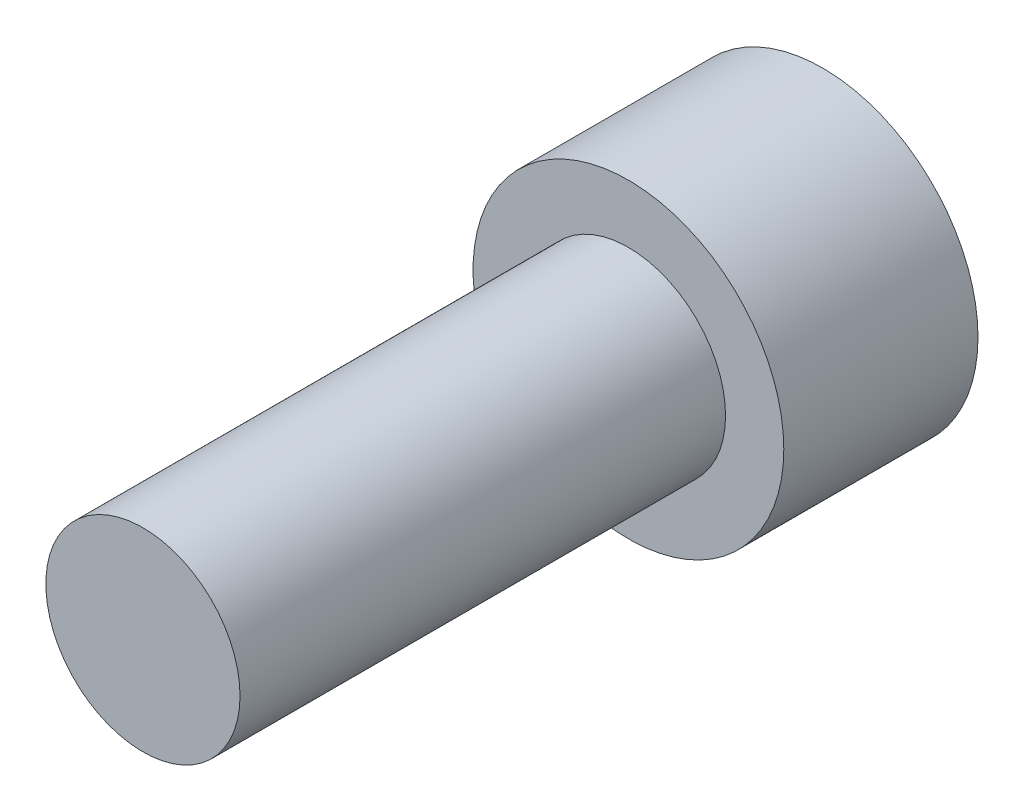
ISO-10303-21;
HEADER;
FILE_DESCRIPTION(('STEP AP214'),'2;1');
FILE_NAME('part.step','',(''),(''),'','','');
FILE_SCHEMA(('AUTOMOTIVE_DESIGN { 1 0 10303 214 1 1 1 1 }'));
ENDSEC;
DATA;
#1=APPLICATION_CONTEXT('core data for automotive mechanical design processes');
#2=APPLICATION_PROTOCOL_DEFINITION('international standard','automotive_design',2000,#1);
#3=PRODUCT_CONTEXT('',#1,'mechanical');
#4=PRODUCT('Part','Part','',(#3));
#5=PRODUCT_RELATED_PRODUCT_CATEGORY('part','',(#4));
#6=PRODUCT_DEFINITION_FORMATION('','',#4);
#7=PRODUCT_DEFINITION_CONTEXT('part definition',#1,'design');
#8=PRODUCT_DEFINITION('design','',#6,#7);
#9=PRODUCT_DEFINITION_SHAPE('','',#8);
#10=(LENGTH_UNIT() NAMED_UNIT(*) SI_UNIT(.MILLI.,.METRE.));
#11=(NAMED_UNIT(*) PLANE_ANGLE_UNIT() SI_UNIT($,.RADIAN.));
#12=(NAMED_UNIT(*) SI_UNIT($,.STERADIAN.) SOLID_ANGLE_UNIT());
#13=UNCERTAINTY_MEASURE_WITH_UNIT(LENGTH_MEASURE(1.E-05),#10,'distance_accuracy_value','');
#14=(GEOMETRIC_REPRESENTATION_CONTEXT(3) GLOBAL_UNCERTAINTY_ASSIGNED_CONTEXT((#13)) GLOBAL_UNIT_ASSIGNED_CONTEXT((#10,
#11,#12)) REPRESENTATION_CONTEXT('',''));
#15=CARTESIAN_POINT('',(0.,0.,0.));
#16=DIRECTION('',(0.,0.,1.));
#17=DIRECTION('',(1.,0.,0.));
#18=AXIS2_PLACEMENT_3D('',#15,#16,#17);
#19=CARTESIAN_POINT('',(0.,0.,25.));
#20=DIRECTION('',(0.,0.,1.));
#21=DIRECTION('',(1.,0.,0.));
#22=AXIS2_PLACEMENT_3D('',#19,#20,#21);
#23=PLANE('',#22);
#24=CARTESIAN_POINT('',(0.,0.,25.));
#25=DIRECTION('',(0.,0.,1.));
#26=DIRECTION('',(1.,0.,0.));
#27=AXIS2_PLACEMENT_3D('',#24,#25,#26);
#28=CIRCLE('',#27,5.);
#29=CARTESIAN_POINT('',(5.,0.,25.));
#30=VERTEX_POINT('',#29);
#31=EDGE_CURVE('E11',#30,#30,#28,.T.);
#32=ORIENTED_EDGE('',*,*,#31,.T.);
#33=EDGE_LOOP('',(#32));
#34=FACE_BOUND('',#33,.T.);
#35=ADVANCED_FACE('F32',(#34),#23,.T.);
#36=CARTESIAN_POINT('',(0.,0.,25.));
#37=DIRECTION('',(0.,0.,1.));
#38=DIRECTION('',(1.,0.,0.));
#39=AXIS2_PLACEMENT_3D('',#36,#37,#38);
#40=CYLINDRICAL_SURFACE('',#39,5.);
#41=CARTESIAN_POINT('',(0.,0.,0.));
#42=DIRECTION('',(0.,0.,1.));
#43=DIRECTION('',(1.,0.,0.));
#44=AXIS2_PLACEMENT_3D('',#41,#42,#43);
#45=CIRCLE('',#44,5.);
#46=CARTESIAN_POINT('',(5.,0.,0.));
#47=VERTEX_POINT('',#46);
#48=EDGE_CURVE('E39',#47,#47,#45,.T.);
#49=ORIENTED_EDGE('',*,*,#48,.T.);
#50=EDGE_LOOP('',(#49));
#51=FACE_BOUND('',#50,.T.);
#52=ORIENTED_EDGE('',*,*,#31,.F.);
#53=EDGE_LOOP('',(#52));
#54=FACE_BOUND('',#53,.T.);
#55=ADVANCED_FACE('F146',(#51,#54),#40,.T.);
#56=CARTESIAN_POINT('',(0.,-5.,0.));
#57=DIRECTION('',(0.,0.,1.));
#58=DIRECTION('',(1.,0.,0.));
#59=AXIS2_PLACEMENT_3D('',#56,#57,#58);
#60=PLANE('',#59);
#61=CARTESIAN_POINT('',(0.,0.,0.));
#62=DIRECTION('',(0.,0.,1.));
#63=DIRECTION('',(1.,0.,0.));
#64=AXIS2_PLACEMENT_3D('',#61,#62,#63);
#65=CIRCLE('',#64,8.);
#66=CARTESIAN_POINT('',(8.,0.,0.));
#67=VERTEX_POINT('',#66);
#68=EDGE_CURVE('E141',#67,#67,#65,.T.);
#69=ORIENTED_EDGE('',*,*,#68,.T.);
#70=EDGE_LOOP('',(#69));
#71=FACE_BOUND('',#70,.T.);
#72=ORIENTED_EDGE('',*,*,#48,.F.);
#73=EDGE_LOOP('',(#72));
#74=FACE_BOUND('',#73,.T.);
#75=ADVANCED_FACE('F149',(#71,#74),#60,.T.);
#76=CARTESIAN_POINT('',(0.,0.,25.));
#77=DIRECTION('',(0.,0.,1.));
#78=DIRECTION('',(1.,0.,0.));
#79=AXIS2_PLACEMENT_3D('',#76,#77,#78);
#80=CYLINDRICAL_SURFACE('',#79,8.);
#81=CARTESIAN_POINT('',(0.,0.,-10.));
#82=DIRECTION('',(0.,0.,1.));
#83=DIRECTION('',(1.,0.,0.));
#84=AXIS2_PLACEMENT_3D('',#81,#82,#83);
#85=CIRCLE('',#84,8.);
#86=CARTESIAN_POINT('',(8.,0.,-10.));
#87=VERTEX_POINT('',#86);
#88=EDGE_CURVE('E133',#87,#87,#85,.T.);
#89=ORIENTED_EDGE('',*,*,#88,.T.);
#90=EDGE_LOOP('',(#89));
#91=FACE_BOUND('',#90,.T.);
#92=ORIENTED_EDGE('',*,*,#68,.F.);
#93=EDGE_LOOP('',(#92));
#94=FACE_BOUND('',#93,.T.);
#95=ADVANCED_FACE('F151',(#91,#94),#80,.T.);
#96=CARTESIAN_POINT('',(0.,-8.,-10.));
#97=DIRECTION('',(0.,0.,-1.));
#98=DIRECTION('',(-1.,0.,0.));
#99=AXIS2_PLACEMENT_3D('',#96,#97,#98);
#100=PLANE('',#99);
#101=DIRECTION('',(0.866025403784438,-0.5,0.));
#102=VECTOR('',#101,1.);
#103=CARTESIAN_POINT('',(0.,4.61880215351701,-10.));
#104=LINE('',#103,#102);
#105=CARTESIAN_POINT('',(0.,4.61880215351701,-10.));
#106=VERTEX_POINT('',#105);
#107=CARTESIAN_POINT('',(4.,2.3094010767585,-10.));
#108=VERTEX_POINT('',#107);
#109=EDGE_CURVE('E46',#106,#108,#104,.T.);
#110=ORIENTED_EDGE('',*,*,#109,.F.);
#111=DIRECTION('',(0.866025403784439,0.5,0.));
#112=VECTOR('',#111,1.);
#113=CARTESIAN_POINT('',(-4.,2.3094010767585,-10.));
#114=LINE('',#113,#112);
#115=CARTESIAN_POINT('',(-4.,2.3094010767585,-10.));
#116=VERTEX_POINT('',#115);
#117=EDGE_CURVE('E129',#116,#106,#114,.T.);
#118=ORIENTED_EDGE('',*,*,#117,.F.);
#119=DIRECTION('',(0.,1.,0.));
#120=VECTOR('',#119,1.);
#121=CARTESIAN_POINT('',(-4.,-2.3094010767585,-10.));
#122=LINE('',#121,#120);
#123=CARTESIAN_POINT('',(-4.,-2.3094010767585,-10.));
#124=VERTEX_POINT('',#123);
#125=EDGE_CURVE('E127',#124,#116,#122,.T.);
#126=ORIENTED_EDGE('',*,*,#125,.F.);
#127=DIRECTION('',(-0.866025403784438,0.5,0.));
#128=VECTOR('',#127,1.);
#129=CARTESIAN_POINT('',(0.,-4.61880215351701,-10.));
#130=LINE('',#129,#128);
#131=CARTESIAN_POINT('',(0.,-4.61880215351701,-10.));
#132=VERTEX_POINT('',#131);
#133=EDGE_CURVE('E94',#132,#124,#130,.T.);
#134=ORIENTED_EDGE('',*,*,#133,.F.);
#135=DIRECTION('',(-0.866025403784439,-0.5,0.));
#136=VECTOR('',#135,1.);
#137=CARTESIAN_POINT('',(4.,-2.3094010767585,-10.));
#138=LINE('',#137,#136);
#139=CARTESIAN_POINT('',(4.,-2.3094010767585,-10.));
#140=VERTEX_POINT('',#139);
#141=EDGE_CURVE('E123',#140,#132,#138,.T.);
#142=ORIENTED_EDGE('',*,*,#141,.F.);
#143=DIRECTION('',(0.,-1.,0.));
#144=VECTOR('',#143,1.);
#145=CARTESIAN_POINT('',(4.,2.3094010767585,-10.));
#146=LINE('',#145,#144);
#147=EDGE_CURVE('E120',#108,#140,#146,.T.);
#148=ORIENTED_EDGE('',*,*,#147,.F.);
#149=EDGE_LOOP('',(#110,#118,#126,#134,#142,#148));
#150=FACE_BOUND('',#149,.T.);
#151=ORIENTED_EDGE('',*,*,#88,.F.);
#152=EDGE_LOOP('',(#151));
#153=FACE_BOUND('',#152,.T.);
#154=ADVANCED_FACE('F158',(#150,#153),#100,.T.);
#155=CARTESIAN_POINT('',(0.,4.61880215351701,-2.));
#156=DIRECTION('',(0.5,0.866025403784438,0.));
#157=DIRECTION('',(-0.866025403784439,0.5,0.));
#158=AXIS2_PLACEMENT_3D('',#155,#156,#157);
#159=PLANE('',#158);
#160=ORIENTED_EDGE('',*,*,#109,.T.);
#161=DIRECTION('',(0.,0.,-1.));
#162=VECTOR('',#161,1.);
#163=CARTESIAN_POINT('',(4.,2.3094010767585,-2.));
#164=LINE('',#163,#162);
#165=CARTESIAN_POINT('',(4.,2.3094010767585,-2.));
#166=VERTEX_POINT('',#165);
#167=EDGE_CURVE('E76',#166,#108,#164,.T.);
#168=ORIENTED_EDGE('',*,*,#167,.F.);
#169=DIRECTION('',(0.866025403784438,-0.5,0.));
#170=VECTOR('',#169,1.);
#171=CARTESIAN_POINT('',(0.,4.61880215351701,-2.));
#172=LINE('',#171,#170);
#173=CARTESIAN_POINT('',(0.,4.61880215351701,-2.));
#174=VERTEX_POINT('',#173);
#175=EDGE_CURVE('E131',#174,#166,#172,.T.);
#176=ORIENTED_EDGE('',*,*,#175,.F.);
#177=DIRECTION('',(0.,0.,-1.));
#178=VECTOR('',#177,1.);
#179=CARTESIAN_POINT('',(0.,4.61880215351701,-2.));
#180=LINE('',#179,#178);
#181=EDGE_CURVE('E54',#174,#106,#180,.T.);
#182=ORIENTED_EDGE('',*,*,#181,.T.);
#183=EDGE_LOOP('',(#160,#168,#176,#182));
#184=FACE_BOUND('',#183,.T.);
#185=ADVANCED_FACE('F189',(#184),#159,.F.);
#186=CARTESIAN_POINT('',(-4.,2.3094010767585,-2.));
#187=DIRECTION('',(-0.5,0.866025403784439,0.));
#188=DIRECTION('',(-0.866025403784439,-0.5,0.));
#189=AXIS2_PLACEMENT_3D('',#186,#187,#188);
#190=PLANE('',#189);
#191=ORIENTED_EDGE('',*,*,#117,.T.);
#192=ORIENTED_EDGE('',*,*,#181,.F.);
#193=DIRECTION('',(0.866025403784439,0.5,0.));
#194=VECTOR('',#193,1.);
#195=CARTESIAN_POINT('',(-4.,2.3094010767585,-2.));
#196=LINE('',#195,#194);
#197=CARTESIAN_POINT('',(-4.,2.3094010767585,-2.));
#198=VERTEX_POINT('',#197);
#199=EDGE_CURVE('E106',#198,#174,#196,.T.);
#200=ORIENTED_EDGE('',*,*,#199,.F.);
#201=DIRECTION('',(0.,0.,-1.));
#202=VECTOR('',#201,1.);
#203=CARTESIAN_POINT('',(-4.,2.3094010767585,-2.));
#204=LINE('',#203,#202);
#205=EDGE_CURVE('E98',#198,#116,#204,.T.);
#206=ORIENTED_EDGE('',*,*,#205,.T.);
#207=EDGE_LOOP('',(#191,#192,#200,#206));
#208=FACE_BOUND('',#207,.T.);
#209=ADVANCED_FACE('F199',(#208),#190,.F.);
#210=CARTESIAN_POINT('',(-4.,-2.3094010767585,-2.));
#211=DIRECTION('',(-1.,0.,0.));
#212=DIRECTION('',(0.,0.,1.));
#213=AXIS2_PLACEMENT_3D('',#210,#211,#212);
#214=PLANE('',#213);
#215=ORIENTED_EDGE('',*,*,#125,.T.);
#216=ORIENTED_EDGE('',*,*,#205,.F.);
#217=DIRECTION('',(0.,1.,0.));
#218=VECTOR('',#217,1.);
#219=CARTESIAN_POINT('',(-4.,-2.3094010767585,-2.));
#220=LINE('',#219,#218);
#221=CARTESIAN_POINT('',(-4.,-2.3094010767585,-2.));
#222=VERTEX_POINT('',#221);
#223=EDGE_CURVE('E102',#222,#198,#220,.T.);
#224=ORIENTED_EDGE('',*,*,#223,.F.);
#225=DIRECTION('',(0.,0.,-1.));
#226=VECTOR('',#225,1.);
#227=CARTESIAN_POINT('',(-4.,-2.3094010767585,-2.));
#228=LINE('',#227,#226);
#229=EDGE_CURVE('E87',#222,#124,#228,.T.);
#230=ORIENTED_EDGE('',*,*,#229,.T.);
#231=EDGE_LOOP('',(#215,#216,#224,#230));
#232=FACE_BOUND('',#231,.T.);
#233=ADVANCED_FACE('F103',(#232),#214,.F.);
#234=CARTESIAN_POINT('',(0.,-4.61880215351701,-2.));
#235=DIRECTION('',(-0.5,-0.866025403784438,0.));
#236=DIRECTION('',(0.866025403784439,-0.5,0.));
#237=AXIS2_PLACEMENT_3D('',#234,#235,#236);
#238=PLANE('',#237);
#239=ORIENTED_EDGE('',*,*,#133,.T.);
#240=ORIENTED_EDGE('',*,*,#229,.F.);
#241=DIRECTION('',(-0.866025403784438,0.5,0.));
#242=VECTOR('',#241,1.);
#243=CARTESIAN_POINT('',(0.,-4.61880215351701,-2.));
#244=LINE('',#243,#242);
#245=CARTESIAN_POINT('',(0.,-4.61880215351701,-2.));
#246=VERTEX_POINT('',#245);
#247=EDGE_CURVE('E91',#246,#222,#244,.T.);
#248=ORIENTED_EDGE('',*,*,#247,.F.);
#249=DIRECTION('',(0.,0.,-1.));
#250=VECTOR('',#249,1.);
#251=CARTESIAN_POINT('',(0.,-4.61880215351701,-2.));
#252=LINE('',#251,#250);
#253=EDGE_CURVE('E99',#246,#132,#252,.T.);
#254=ORIENTED_EDGE('',*,*,#253,.T.);
#255=EDGE_LOOP('',(#239,#240,#248,#254));
#256=FACE_BOUND('',#255,.T.);
#257=ADVANCED_FACE('F89',(#256),#238,.F.);
#258=CARTESIAN_POINT('',(4.,-2.3094010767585,-2.));
#259=DIRECTION('',(0.5,-0.866025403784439,0.));
#260=DIRECTION('',(0.866025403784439,0.5,0.));
#261=AXIS2_PLACEMENT_3D('',#258,#259,#260);
#262=PLANE('',#261);
#263=ORIENTED_EDGE('',*,*,#141,.T.);
#264=ORIENTED_EDGE('',*,*,#253,.F.);
#265=DIRECTION('',(-0.866025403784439,-0.5,0.));
#266=VECTOR('',#265,1.);
#267=CARTESIAN_POINT('',(4.,-2.3094010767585,-2.));
#268=LINE('',#267,#266);
#269=CARTESIAN_POINT('',(4.,-2.3094010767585,-2.));
#270=VERTEX_POINT('',#269);
#271=EDGE_CURVE('E112',#270,#246,#268,.T.);
#272=ORIENTED_EDGE('',*,*,#271,.F.);
#273=DIRECTION('',(0.,0.,-1.));
#274=VECTOR('',#273,1.);
#275=CARTESIAN_POINT('',(4.,-2.3094010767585,-2.));
#276=LINE('',#275,#274);
#277=EDGE_CURVE('E136',#270,#140,#276,.T.);
#278=ORIENTED_EDGE('',*,*,#277,.T.);
#279=EDGE_LOOP('',(#263,#264,#272,#278));
#280=FACE_BOUND('',#279,.T.);
#281=ADVANCED_FACE('F224',(#280),#262,.F.);
#282=CARTESIAN_POINT('',(4.,2.3094010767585,-2.));
#283=DIRECTION('',(1.,0.,0.));
#284=DIRECTION('',(0.,0.,-1.));
#285=AXIS2_PLACEMENT_3D('',#282,#283,#284);
#286=PLANE('',#285);
#287=ORIENTED_EDGE('',*,*,#147,.T.);
#288=ORIENTED_EDGE('',*,*,#277,.F.);
#289=DIRECTION('',(0.,-1.,0.));
#290=VECTOR('',#289,1.);
#291=CARTESIAN_POINT('',(4.,2.3094010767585,-2.));
#292=LINE('',#291,#290);
#293=EDGE_CURVE('E114',#166,#270,#292,.T.);
#294=ORIENTED_EDGE('',*,*,#293,.F.);
#295=ORIENTED_EDGE('',*,*,#167,.T.);
#296=EDGE_LOOP('',(#287,#288,#294,#295));
#297=FACE_BOUND('',#296,.T.);
#298=ADVANCED_FACE('F233',(#297),#286,.F.);
#299=CARTESIAN_POINT('',(8.,0.,-2.));
#300=DIRECTION('',(0.,0.,-1.));
#301=DIRECTION('',(-1.,0.,0.));
#302=AXIS2_PLACEMENT_3D('',#299,#300,#301);
#303=PLANE('',#302);
#304=ORIENTED_EDGE('',*,*,#175,.T.);
#305=ORIENTED_EDGE('',*,*,#293,.T.);
#306=ORIENTED_EDGE('',*,*,#271,.T.);
#307=ORIENTED_EDGE('',*,*,#247,.T.);
#308=ORIENTED_EDGE('',*,*,#223,.T.);
#309=ORIENTED_EDGE('',*,*,#199,.T.);
#310=EDGE_LOOP('',(#304,#305,#306,#307,#308,#309));
#311=FACE_BOUND('',#310,.T.);
#312=ADVANCED_FACE('F109',(#311),#303,.T.);
#313=CLOSED_SHELL('',(#35,#55,#75,#95,#154,#185,#209,#233,#257,#281,#298,#312));
#314=MANIFOLD_SOLID_BREP('B2',#313);
#315=ADVANCED_BREP_SHAPE_REPRESENTATION('',(#18,#314),#14);
#316=SHAPE_DEFINITION_REPRESENTATION(#9,#315);
ENDSEC;
END-ISO-10303-21;
